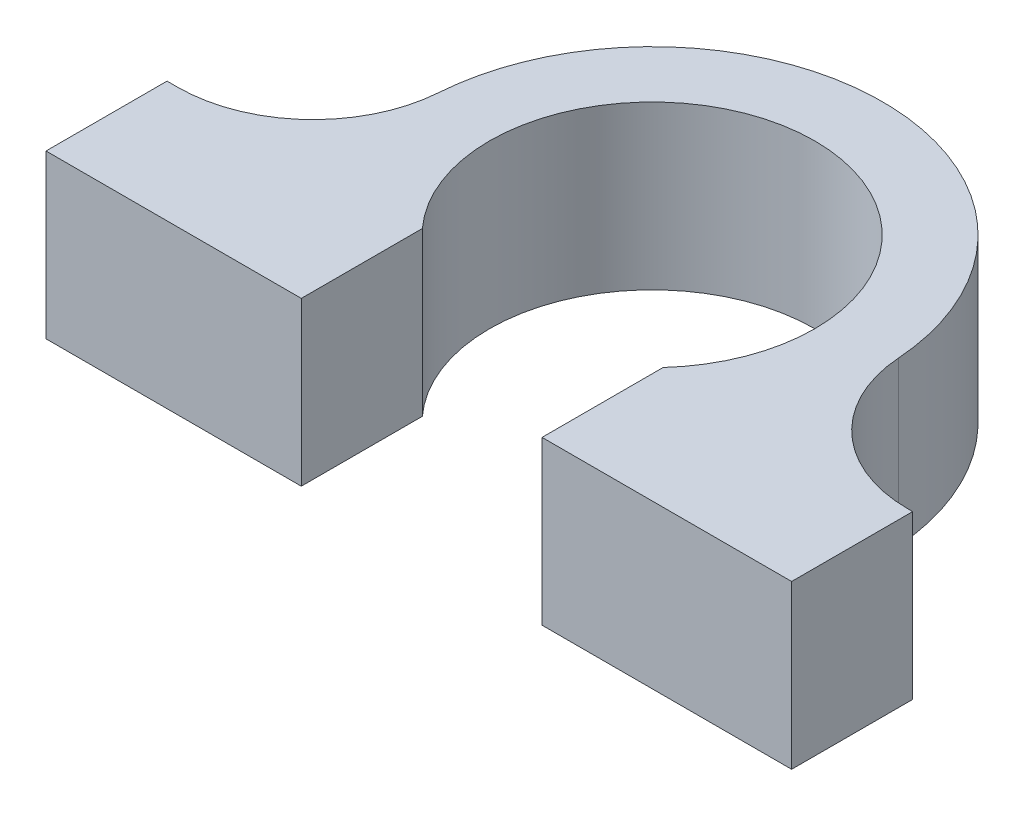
ISO-10303-21;
HEADER;
FILE_DESCRIPTION(('STEP AP214'),'2;1');
FILE_NAME('part.step','',(''),(''),'','','');
FILE_SCHEMA(('AUTOMOTIVE_DESIGN { 1 0 10303 214 1 1 1 1 }'));
ENDSEC;
DATA;
#1=APPLICATION_CONTEXT('core data for automotive mechanical design processes');
#2=APPLICATION_PROTOCOL_DEFINITION('international standard','automotive_design',2000,#1);
#3=PRODUCT_CONTEXT('',#1,'mechanical');
#4=PRODUCT('Part','Part','',(#3));
#5=PRODUCT_RELATED_PRODUCT_CATEGORY('part','',(#4));
#6=PRODUCT_DEFINITION_FORMATION('','',#4);
#7=PRODUCT_DEFINITION_CONTEXT('part definition',#1,'design');
#8=PRODUCT_DEFINITION('design','',#6,#7);
#9=PRODUCT_DEFINITION_SHAPE('','',#8);
#10=(LENGTH_UNIT() NAMED_UNIT(*) SI_UNIT(.MILLI.,.METRE.));
#11=(NAMED_UNIT(*) PLANE_ANGLE_UNIT() SI_UNIT($,.RADIAN.));
#12=(NAMED_UNIT(*) SI_UNIT($,.STERADIAN.) SOLID_ANGLE_UNIT());
#13=UNCERTAINTY_MEASURE_WITH_UNIT(LENGTH_MEASURE(1.E-05),#10,'distance_accuracy_value','');
#14=(GEOMETRIC_REPRESENTATION_CONTEXT(3) GLOBAL_UNCERTAINTY_ASSIGNED_CONTEXT((#13)) GLOBAL_UNIT_ASSIGNED_CONTEXT((#10,
#11,#12)) REPRESENTATION_CONTEXT('',''));
#15=CARTESIAN_POINT('',(0.,0.,0.));
#16=DIRECTION('',(0.,0.,1.));
#17=DIRECTION('',(1.,0.,0.));
#18=AXIS2_PLACEMENT_3D('',#15,#16,#17);
#19=CARTESIAN_POINT('',(8.87938112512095,12.,17.));
#20=DIRECTION('',(0.,0.,-1.));
#21=DIRECTION('',(-1.,0.,0.));
#22=AXIS2_PLACEMENT_3D('',#19,#20,#21);
#23=PLANE('',#22);
#24=DIRECTION('',(1.,0.,0.));
#25=VECTOR('',#24,1.);
#26=CARTESIAN_POINT('',(8.87938112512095,0.,17.));
#27=LINE('',#26,#25);
#28=CARTESIAN_POINT('',(8.87938112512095,0.,17.));
#29=VERTEX_POINT('',#28);
#30=CARTESIAN_POINT('',(27.2889464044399,0.,17.));
#31=VERTEX_POINT('',#30);
#32=EDGE_CURVE('E153',#29,#31,#27,.T.);
#33=ORIENTED_EDGE('',*,*,#32,.T.);
#34=DIRECTION('',(0.,-1.,0.));
#35=VECTOR('',#34,1.);
#36=CARTESIAN_POINT('',(27.2889464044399,12.,17.));
#37=LINE('',#36,#35);
#38=CARTESIAN_POINT('',(27.2889464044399,12.,17.));
#39=VERTEX_POINT('',#38);
#40=EDGE_CURVE('E11',#39,#31,#37,.T.);
#41=ORIENTED_EDGE('',*,*,#40,.F.);
#42=DIRECTION('',(1.,0.,0.));
#43=VECTOR('',#42,1.);
#44=CARTESIAN_POINT('',(8.87938112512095,12.,17.));
#45=LINE('',#44,#43);
#46=CARTESIAN_POINT('',(8.87938112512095,12.,17.));
#47=VERTEX_POINT('',#46);
#48=EDGE_CURVE('E175',#47,#39,#45,.T.);
#49=ORIENTED_EDGE('',*,*,#48,.F.);
#50=DIRECTION('',(0.,-1.,0.));
#51=VECTOR('',#50,1.);
#52=CARTESIAN_POINT('',(8.87938112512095,12.,17.));
#53=LINE('',#52,#51);
#54=EDGE_CURVE('E149',#47,#29,#53,.T.);
#55=ORIENTED_EDGE('',*,*,#54,.T.);
#56=EDGE_LOOP('',(#33,#41,#49,#55));
#57=FACE_BOUND('',#56,.T.);
#58=ADVANCED_FACE('F33',(#57),#23,.F.);
#59=CARTESIAN_POINT('',(27.2889464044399,12.,8.07196325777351));
#60=DIRECTION('',(-1.,0.,0.));
#61=DIRECTION('',(0.,0.,1.));
#62=AXIS2_PLACEMENT_3D('',#59,#60,#61);
#63=PLANE('',#62);
#64=DIRECTION('',(0.,0.,-1.));
#65=VECTOR('',#64,1.);
#66=CARTESIAN_POINT('',(27.2889464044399,0.,8.07196325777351));
#67=LINE('',#66,#65);
#68=CARTESIAN_POINT('',(27.2889464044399,0.,8.07196325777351));
#69=VERTEX_POINT('',#68);
#70=EDGE_CURVE('E156',#31,#69,#67,.T.);
#71=ORIENTED_EDGE('',*,*,#70,.T.);
#72=DIRECTION('',(0.,-1.,0.));
#73=VECTOR('',#72,1.);
#74=CARTESIAN_POINT('',(27.2889464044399,12.,8.07196325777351));
#75=LINE('',#74,#73);
#76=CARTESIAN_POINT('',(27.2889464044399,12.,8.07196325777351));
#77=VERTEX_POINT('',#76);
#78=EDGE_CURVE('E41',#77,#69,#75,.T.);
#79=ORIENTED_EDGE('',*,*,#78,.F.);
#80=DIRECTION('',(0.,0.,-1.));
#81=VECTOR('',#80,1.);
#82=CARTESIAN_POINT('',(27.2889464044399,12.,8.07196325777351));
#83=LINE('',#82,#81);
#84=EDGE_CURVE('E104',#39,#77,#83,.T.);
#85=ORIENTED_EDGE('',*,*,#84,.F.);
#86=ORIENTED_EDGE('',*,*,#40,.T.);
#87=EDGE_LOOP('',(#71,#79,#85,#86));
#88=FACE_BOUND('',#87,.T.);
#89=ADVANCED_FACE('F253',(#88),#63,.F.);
#90=CARTESIAN_POINT('',(26.9310726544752,12.,8.07196325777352));
#91=DIRECTION('',(0.,0.,1.));
#92=DIRECTION('',(1.,0.,0.));
#93=AXIS2_PLACEMENT_3D('',#90,#91,#92);
#94=PLANE('',#93);
#95=DIRECTION('',(-1.,0.,0.));
#96=VECTOR('',#95,1.);
#97=CARTESIAN_POINT('',(26.9310726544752,0.,8.07196325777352));
#98=LINE('',#97,#96);
#99=CARTESIAN_POINT('',(26.9310726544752,0.,8.07196325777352));
#100=VERTEX_POINT('',#99);
#101=EDGE_CURVE('E158',#69,#100,#98,.T.);
#102=ORIENTED_EDGE('',*,*,#101,.T.);
#103=DIRECTION('',(0.,-1.,0.));
#104=VECTOR('',#103,1.);
#105=CARTESIAN_POINT('',(26.9310726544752,12.,8.07196325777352));
#106=LINE('',#105,#104);
#107=CARTESIAN_POINT('',(26.9310726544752,12.,8.07196325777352));
#108=VERTEX_POINT('',#107);
#109=EDGE_CURVE('E194',#108,#100,#106,.T.);
#110=ORIENTED_EDGE('',*,*,#109,.F.);
#111=DIRECTION('',(-1.,0.,0.));
#112=VECTOR('',#111,1.);
#113=CARTESIAN_POINT('',(26.9310726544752,12.,8.07196325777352));
#114=LINE('',#113,#112);
#115=EDGE_CURVE('E202',#77,#108,#114,.T.);
#116=ORIENTED_EDGE('',*,*,#115,.F.);
#117=ORIENTED_EDGE('',*,*,#78,.T.);
#118=EDGE_LOOP('',(#102,#110,#116,#117));
#119=FACE_BOUND('',#118,.T.);
#120=ADVANCED_FACE('F200',(#119),#94,.F.);
#121=CARTESIAN_POINT('',(26.9310726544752,12.,-1.92803674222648));
#122=DIRECTION('',(0.,-1.,0.));
#123=DIRECTION('',(0.,0.,-1.));
#124=AXIS2_PLACEMENT_3D('',#121,#122,#123);
#125=CYLINDRICAL_SURFACE('',#124,10.);
#126=CARTESIAN_POINT('',(26.9310726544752,0.,-1.92803674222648));
#127=DIRECTION('',(0.,-1.,0.));
#128=DIRECTION('',(0.,0.,1.));
#129=AXIS2_PLACEMENT_3D('',#126,#127,#128);
#130=CIRCLE('',#129,10.);
#131=CARTESIAN_POINT('',(16.9566013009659,0.,-1.21394905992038));
#132=VERTEX_POINT('',#131);
#133=EDGE_CURVE('E160',#100,#132,#130,.T.);
#134=ORIENTED_EDGE('',*,*,#133,.T.);
#135=DIRECTION('',(0.,-1.,0.));
#136=VECTOR('',#135,1.);
#137=CARTESIAN_POINT('',(16.9566013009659,12.,-1.21394905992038));
#138=LINE('',#137,#136);
#139=CARTESIAN_POINT('',(16.9566013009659,12.,-1.21394905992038));
#140=VERTEX_POINT('',#139);
#141=EDGE_CURVE('E191',#140,#132,#138,.T.);
#142=ORIENTED_EDGE('',*,*,#141,.F.);
#143=CARTESIAN_POINT('',(26.9310726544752,12.,-1.92803674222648));
#144=DIRECTION('',(0.,-1.,0.));
#145=DIRECTION('',(0.,0.,1.));
#146=AXIS2_PLACEMENT_3D('',#143,#144,#145);
#147=CIRCLE('',#146,10.);
#148=EDGE_CURVE('E220',#108,#140,#147,.T.);
#149=ORIENTED_EDGE('',*,*,#148,.F.);
#150=ORIENTED_EDGE('',*,*,#109,.T.);
#151=EDGE_LOOP('',(#134,#142,#149,#150));
#152=FACE_BOUND('',#151,.T.);
#153=ADVANCED_FACE('F211',(#152),#125,.F.);
#154=CARTESIAN_POINT('',(0.,12.,0.));
#155=DIRECTION('',(0.,-1.,0.));
#156=DIRECTION('',(0.,0.,-1.));
#157=AXIS2_PLACEMENT_3D('',#154,#155,#156);
#158=CYLINDRICAL_SURFACE('',#157,17.);
#159=CARTESIAN_POINT('',(0.,0.,0.));
#160=DIRECTION('',(0.,1.,0.));
#161=DIRECTION('',(0.,0.,1.));
#162=AXIS2_PLACEMENT_3D('',#159,#160,#161);
#163=CIRCLE('',#162,17.);
#164=CARTESIAN_POINT('',(-16.9566013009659,0.,-1.21394905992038));
#165=VERTEX_POINT('',#164);
#166=EDGE_CURVE('E162',#132,#165,#163,.T.);
#167=ORIENTED_EDGE('',*,*,#166,.T.);
#168=DIRECTION('',(0.,-1.,0.));
#169=VECTOR('',#168,1.);
#170=CARTESIAN_POINT('',(-16.9566013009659,12.,-1.21394905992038));
#171=LINE('',#170,#169);
#172=CARTESIAN_POINT('',(-16.9566013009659,12.,-1.21394905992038));
#173=VERTEX_POINT('',#172);
#174=EDGE_CURVE('E188',#173,#165,#171,.T.);
#175=ORIENTED_EDGE('',*,*,#174,.F.);
#176=CARTESIAN_POINT('',(0.,12.,0.));
#177=DIRECTION('',(0.,1.,0.));
#178=DIRECTION('',(0.,0.,1.));
#179=AXIS2_PLACEMENT_3D('',#176,#177,#178);
#180=CIRCLE('',#179,17.);
#181=EDGE_CURVE('E217',#140,#173,#180,.T.);
#182=ORIENTED_EDGE('',*,*,#181,.F.);
#183=ORIENTED_EDGE('',*,*,#141,.T.);
#184=EDGE_LOOP('',(#167,#175,#182,#183));
#185=FACE_BOUND('',#184,.T.);
#186=ADVANCED_FACE('F215',(#185),#158,.T.);
#187=CARTESIAN_POINT('',(-26.9310726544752,12.,-1.92803674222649));
#188=DIRECTION('',(0.,-1.,0.));
#189=DIRECTION('',(0.,0.,-1.));
#190=AXIS2_PLACEMENT_3D('',#187,#188,#189);
#191=CYLINDRICAL_SURFACE('',#190,10.);
#192=CARTESIAN_POINT('',(-26.9310726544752,0.,-1.92803674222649));
#193=DIRECTION('',(0.,-1.,0.));
#194=DIRECTION('',(0.,0.,-1.));
#195=AXIS2_PLACEMENT_3D('',#192,#193,#194);
#196=CIRCLE('',#195,10.);
#197=CARTESIAN_POINT('',(-26.9310726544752,0.,8.07196325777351));
#198=VERTEX_POINT('',#197);
#199=EDGE_CURVE('E164',#165,#198,#196,.T.);
#200=ORIENTED_EDGE('',*,*,#199,.T.);
#201=DIRECTION('',(0.,-1.,0.));
#202=VECTOR('',#201,1.);
#203=CARTESIAN_POINT('',(-26.9310726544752,12.,8.07196325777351));
#204=LINE('',#203,#202);
#205=CARTESIAN_POINT('',(-26.9310726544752,12.,8.07196325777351));
#206=VERTEX_POINT('',#205);
#207=EDGE_CURVE('E185',#206,#198,#204,.T.);
#208=ORIENTED_EDGE('',*,*,#207,.F.);
#209=CARTESIAN_POINT('',(-26.9310726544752,12.,-1.92803674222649));
#210=DIRECTION('',(0.,-1.,0.));
#211=DIRECTION('',(0.,0.,-1.));
#212=AXIS2_PLACEMENT_3D('',#209,#210,#211);
#213=CIRCLE('',#212,10.);
#214=EDGE_CURVE('E219',#173,#206,#213,.T.);
#215=ORIENTED_EDGE('',*,*,#214,.F.);
#216=ORIENTED_EDGE('',*,*,#174,.T.);
#217=EDGE_LOOP('',(#200,#208,#215,#216));
#218=FACE_BOUND('',#217,.T.);
#219=ADVANCED_FACE('F266',(#218),#191,.F.);
#220=CARTESIAN_POINT('',(-27.7110535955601,12.,8.07196325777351));
#221=DIRECTION('',(0.,0.,1.));
#222=DIRECTION('',(1.,0.,0.));
#223=AXIS2_PLACEMENT_3D('',#220,#221,#222);
#224=PLANE('',#223);
#225=DIRECTION('',(-1.,0.,0.));
#226=VECTOR('',#225,1.);
#227=CARTESIAN_POINT('',(-27.7110535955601,0.,8.07196325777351));
#228=LINE('',#227,#226);
#229=CARTESIAN_POINT('',(-27.7110535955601,0.,8.07196325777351));
#230=VERTEX_POINT('',#229);
#231=EDGE_CURVE('E166',#198,#230,#228,.T.);
#232=ORIENTED_EDGE('',*,*,#231,.T.);
#233=DIRECTION('',(0.,-1.,0.));
#234=VECTOR('',#233,1.);
#235=CARTESIAN_POINT('',(-27.7110535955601,12.,8.07196325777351));
#236=LINE('',#235,#234);
#237=CARTESIAN_POINT('',(-27.7110535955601,12.,8.07196325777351));
#238=VERTEX_POINT('',#237);
#239=EDGE_CURVE('E182',#238,#230,#236,.T.);
#240=ORIENTED_EDGE('',*,*,#239,.F.);
#241=DIRECTION('',(-1.,0.,0.));
#242=VECTOR('',#241,1.);
#243=CARTESIAN_POINT('',(-27.7110535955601,12.,8.07196325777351));
#244=LINE('',#243,#242);
#245=EDGE_CURVE('E222',#206,#238,#244,.T.);
#246=ORIENTED_EDGE('',*,*,#245,.F.);
#247=ORIENTED_EDGE('',*,*,#207,.T.);
#248=EDGE_LOOP('',(#232,#240,#246,#247));
#249=FACE_BOUND('',#248,.T.);
#250=ADVANCED_FACE('F269',(#249),#224,.F.);
#251=CARTESIAN_POINT('',(-27.7110535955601,12.,8.07196325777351));
#252=DIRECTION('',(1.,0.,0.));
#253=DIRECTION('',(0.,0.,-1.));
#254=AXIS2_PLACEMENT_3D('',#251,#252,#253);
#255=PLANE('',#254);
#256=DIRECTION('',(0.,0.,1.));
#257=VECTOR('',#256,1.);
#258=CARTESIAN_POINT('',(-27.7110535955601,0.,8.07196325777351));
#259=LINE('',#258,#257);
#260=CARTESIAN_POINT('',(-27.7110535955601,0.,17.));
#261=VERTEX_POINT('',#260);
#262=EDGE_CURVE('E168',#230,#261,#259,.T.);
#263=ORIENTED_EDGE('',*,*,#262,.T.);
#264=DIRECTION('',(0.,-1.,0.));
#265=VECTOR('',#264,1.);
#266=CARTESIAN_POINT('',(-27.7110535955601,12.,17.));
#267=LINE('',#266,#265);
#268=CARTESIAN_POINT('',(-27.7110535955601,12.,17.));
#269=VERTEX_POINT('',#268);
#270=EDGE_CURVE('E179',#269,#261,#267,.T.);
#271=ORIENTED_EDGE('',*,*,#270,.F.);
#272=DIRECTION('',(0.,0.,1.));
#273=VECTOR('',#272,1.);
#274=CARTESIAN_POINT('',(-27.7110535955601,12.,8.07196325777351));
#275=LINE('',#274,#273);
#276=EDGE_CURVE('E228',#238,#269,#275,.T.);
#277=ORIENTED_EDGE('',*,*,#276,.F.);
#278=ORIENTED_EDGE('',*,*,#239,.T.);
#279=EDGE_LOOP('',(#263,#271,#277,#278));
#280=FACE_BOUND('',#279,.T.);
#281=ADVANCED_FACE('F234',(#280),#255,.F.);
#282=CARTESIAN_POINT('',(-27.7110535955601,12.,17.));
#283=DIRECTION('',(0.,0.,-1.));
#284=DIRECTION('',(-1.,0.,0.));
#285=AXIS2_PLACEMENT_3D('',#282,#283,#284);
#286=PLANE('',#285);
#287=DIRECTION('',(1.,0.,0.));
#288=VECTOR('',#287,1.);
#289=CARTESIAN_POINT('',(-27.7110535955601,0.,17.));
#290=LINE('',#289,#288);
#291=CARTESIAN_POINT('',(-8.87938112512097,0.,17.));
#292=VERTEX_POINT('',#291);
#293=EDGE_CURVE('E170',#261,#292,#290,.T.);
#294=ORIENTED_EDGE('',*,*,#293,.T.);
#295=DIRECTION('',(0.,-1.,0.));
#296=VECTOR('',#295,1.);
#297=CARTESIAN_POINT('',(-8.87938112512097,12.,17.));
#298=LINE('',#297,#296);
#299=CARTESIAN_POINT('',(-8.87938112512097,12.,17.));
#300=VERTEX_POINT('',#299);
#301=EDGE_CURVE('E144',#300,#292,#298,.T.);
#302=ORIENTED_EDGE('',*,*,#301,.F.);
#303=DIRECTION('',(1.,0.,0.));
#304=VECTOR('',#303,1.);
#305=CARTESIAN_POINT('',(-27.7110535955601,12.,17.));
#306=LINE('',#305,#304);
#307=EDGE_CURVE('E135',#269,#300,#306,.T.);
#308=ORIENTED_EDGE('',*,*,#307,.F.);
#309=ORIENTED_EDGE('',*,*,#270,.T.);
#310=EDGE_LOOP('',(#294,#302,#308,#309));
#311=FACE_BOUND('',#310,.T.);
#312=ADVANCED_FACE('F238',(#311),#286,.F.);
#313=CARTESIAN_POINT('',(-8.87938112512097,12.,8.07196325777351));
#314=DIRECTION('',(-1.,0.,0.));
#315=DIRECTION('',(0.,0.,1.));
#316=AXIS2_PLACEMENT_3D('',#313,#314,#315);
#317=PLANE('',#316);
#318=DIRECTION('',(0.,0.,-1.));
#319=VECTOR('',#318,1.);
#320=CARTESIAN_POINT('',(-8.87938112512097,0.,8.07196325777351));
#321=LINE('',#320,#319);
#322=CARTESIAN_POINT('',(-8.87938112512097,0.,8.0719632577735));
#323=VERTEX_POINT('',#322);
#324=EDGE_CURVE('E143',#292,#323,#321,.T.);
#325=ORIENTED_EDGE('',*,*,#324,.T.);
#326=DIRECTION('',(0.,-1.,0.));
#327=VECTOR('',#326,1.);
#328=CARTESIAN_POINT('',(-8.87938112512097,12.,8.0719632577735));
#329=LINE('',#328,#327);
#330=CARTESIAN_POINT('',(-8.87938112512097,12.,8.0719632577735));
#331=VERTEX_POINT('',#330);
#332=EDGE_CURVE('E140',#331,#323,#329,.T.);
#333=ORIENTED_EDGE('',*,*,#332,.F.);
#334=DIRECTION('',(0.,0.,-1.));
#335=VECTOR('',#334,1.);
#336=CARTESIAN_POINT('',(-8.87938112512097,12.,8.07196325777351));
#337=LINE('',#336,#335);
#338=EDGE_CURVE('E129',#300,#331,#337,.T.);
#339=ORIENTED_EDGE('',*,*,#338,.F.);
#340=ORIENTED_EDGE('',*,*,#301,.T.);
#341=EDGE_LOOP('',(#325,#333,#339,#340));
#342=FACE_BOUND('',#341,.T.);
#343=ADVANCED_FACE('F141',(#342),#317,.F.);
#344=CARTESIAN_POINT('',(0.,12.,0.));
#345=DIRECTION('',(0.,-1.,0.));
#346=DIRECTION('',(0.,0.,-1.));
#347=AXIS2_PLACEMENT_3D('',#344,#345,#346);
#348=CYLINDRICAL_SURFACE('',#347,12.);
#349=CARTESIAN_POINT('',(0.,0.,0.));
#350=DIRECTION('',(0.,-1.,0.));
#351=DIRECTION('',(0.,0.,1.));
#352=AXIS2_PLACEMENT_3D('',#349,#350,#351);
#353=CIRCLE('',#352,12.);
#354=CARTESIAN_POINT('',(8.87938112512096,0.,8.07196325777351));
#355=VERTEX_POINT('',#354);
#356=EDGE_CURVE('E90',#323,#355,#353,.T.);
#357=ORIENTED_EDGE('',*,*,#356,.T.);
#358=DIRECTION('',(0.,-1.,0.));
#359=VECTOR('',#358,1.);
#360=CARTESIAN_POINT('',(8.87938112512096,12.,8.07196325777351));
#361=LINE('',#360,#359);
#362=CARTESIAN_POINT('',(8.87938112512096,12.,8.07196325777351));
#363=VERTEX_POINT('',#362);
#364=EDGE_CURVE('E145',#363,#355,#361,.T.);
#365=ORIENTED_EDGE('',*,*,#364,.F.);
#366=CARTESIAN_POINT('',(0.,12.,0.));
#367=DIRECTION('',(0.,-1.,0.));
#368=DIRECTION('',(0.,0.,1.));
#369=AXIS2_PLACEMENT_3D('',#366,#367,#368);
#370=CIRCLE('',#369,12.);
#371=EDGE_CURVE('E133',#331,#363,#370,.T.);
#372=ORIENTED_EDGE('',*,*,#371,.F.);
#373=ORIENTED_EDGE('',*,*,#332,.T.);
#374=EDGE_LOOP('',(#357,#365,#372,#373));
#375=FACE_BOUND('',#374,.T.);
#376=ADVANCED_FACE('F147',(#375),#348,.F.);
#377=CARTESIAN_POINT('',(8.87938112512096,12.,8.07196325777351));
#378=DIRECTION('',(1.,0.,0.));
#379=DIRECTION('',(0.,0.,-1.));
#380=AXIS2_PLACEMENT_3D('',#377,#378,#379);
#381=PLANE('',#380);
#382=DIRECTION('',(0.,0.,1.));
#383=VECTOR('',#382,1.);
#384=CARTESIAN_POINT('',(8.87938112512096,0.,8.07196325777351));
#385=LINE('',#384,#383);
#386=EDGE_CURVE('E96',#355,#29,#385,.T.);
#387=ORIENTED_EDGE('',*,*,#386,.T.);
#388=ORIENTED_EDGE('',*,*,#54,.F.);
#389=DIRECTION('',(0.,0.,1.));
#390=VECTOR('',#389,1.);
#391=CARTESIAN_POINT('',(8.87938112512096,12.,8.07196325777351));
#392=LINE('',#391,#390);
#393=EDGE_CURVE('E49',#363,#47,#392,.T.);
#394=ORIENTED_EDGE('',*,*,#393,.F.);
#395=ORIENTED_EDGE('',*,*,#364,.T.);
#396=EDGE_LOOP('',(#387,#388,#394,#395));
#397=FACE_BOUND('',#396,.T.);
#398=ADVANCED_FACE('F242',(#397),#381,.F.);
#399=CARTESIAN_POINT('',(26.9310726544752,12.,-1.92803674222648));
#400=DIRECTION('',(0.,1.,0.));
#401=DIRECTION('',(0.,0.,1.));
#402=AXIS2_PLACEMENT_3D('',#399,#400,#401);
#403=PLANE('',#402);
#404=ORIENTED_EDGE('',*,*,#48,.T.);
#405=ORIENTED_EDGE('',*,*,#84,.T.);
#406=ORIENTED_EDGE('',*,*,#115,.T.);
#407=ORIENTED_EDGE('',*,*,#148,.T.);
#408=ORIENTED_EDGE('',*,*,#181,.T.);
#409=ORIENTED_EDGE('',*,*,#214,.T.);
#410=ORIENTED_EDGE('',*,*,#245,.T.);
#411=ORIENTED_EDGE('',*,*,#276,.T.);
#412=ORIENTED_EDGE('',*,*,#307,.T.);
#413=ORIENTED_EDGE('',*,*,#338,.T.);
#414=ORIENTED_EDGE('',*,*,#371,.T.);
#415=ORIENTED_EDGE('',*,*,#393,.T.);
#416=EDGE_LOOP('',(#404,#405,#406,#407,#408,#409,#410,#411,#412,#413,#414,#415));
#417=FACE_BOUND('',#416,.T.);
#418=ADVANCED_FACE('F131',(#417),#403,.T.);
#419=CARTESIAN_POINT('',(26.9310726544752,0.,-1.92803674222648));
#420=DIRECTION('',(0.,1.,0.));
#421=DIRECTION('',(0.,0.,1.));
#422=AXIS2_PLACEMENT_3D('',#419,#420,#421);
#423=PLANE('',#422);
#424=ORIENTED_EDGE('',*,*,#32,.F.);
#425=ORIENTED_EDGE('',*,*,#386,.F.);
#426=ORIENTED_EDGE('',*,*,#356,.F.);
#427=ORIENTED_EDGE('',*,*,#324,.F.);
#428=ORIENTED_EDGE('',*,*,#293,.F.);
#429=ORIENTED_EDGE('',*,*,#262,.F.);
#430=ORIENTED_EDGE('',*,*,#231,.F.);
#431=ORIENTED_EDGE('',*,*,#199,.F.);
#432=ORIENTED_EDGE('',*,*,#166,.F.);
#433=ORIENTED_EDGE('',*,*,#133,.F.);
#434=ORIENTED_EDGE('',*,*,#101,.F.);
#435=ORIENTED_EDGE('',*,*,#70,.F.);
#436=EDGE_LOOP('',(#424,#425,#426,#427,#428,#429,#430,#431,#432,#433,#434,#435));
#437=FACE_BOUND('',#436,.T.);
#438=ADVANCED_FACE('F206',(#437),#423,.F.);
#439=CLOSED_SHELL('',(#58,#89,#120,#153,#186,#219,#250,#281,#312,#343,#376,#398,#418,#438));
#440=MANIFOLD_SOLID_BREP('B2',#439);
#441=ADVANCED_BREP_SHAPE_REPRESENTATION('',(#18,#440),#14);
#442=SHAPE_DEFINITION_REPRESENTATION(#9,#441);
ENDSEC;
END-ISO-10303-21;
